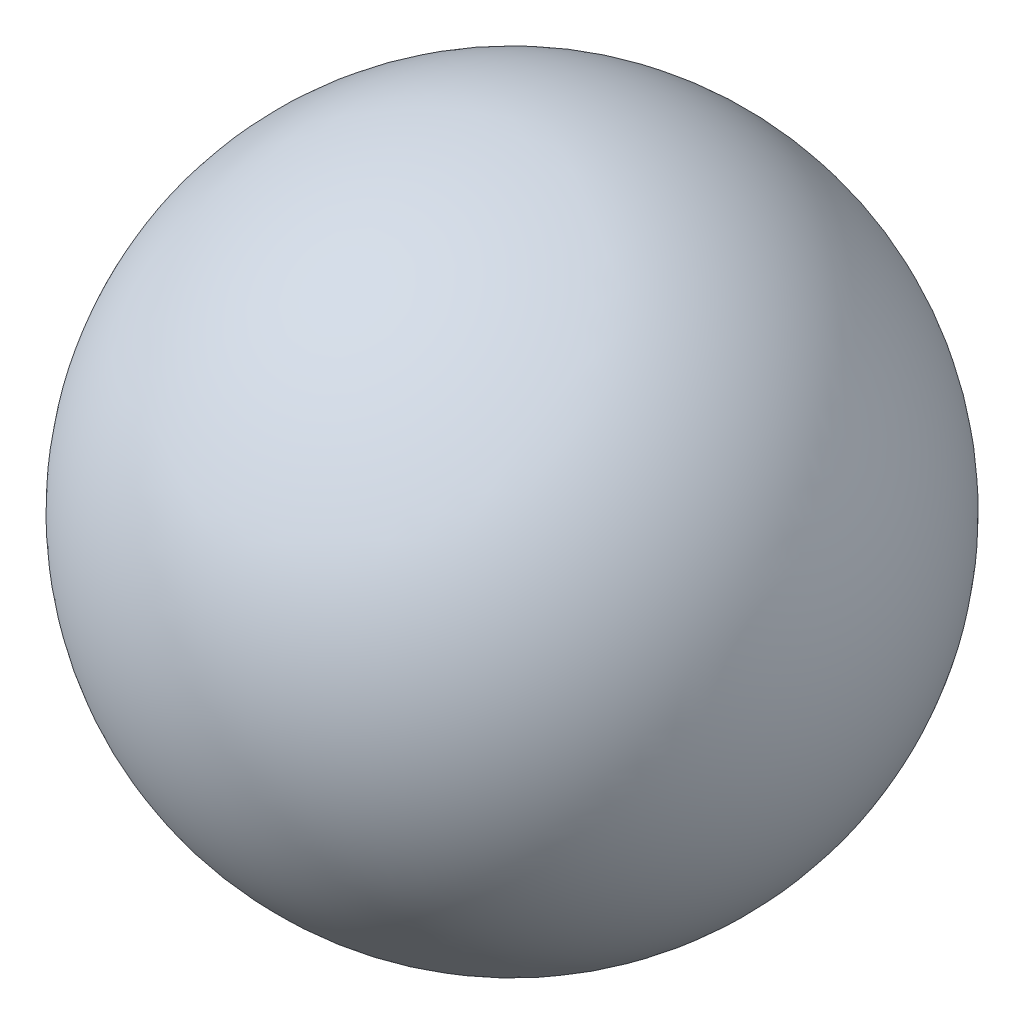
from build123d import *


with BuildPart() as part:
    # Esquisse1 → Base-R_volution (revolve)
    with BuildSketch(Plane(origin=(0, 0, 0), x_dir=(1, 0, 0), z_dir=(0, 1, 0))):
        with BuildLine():
            Line((0.95, 3.45), (5.45, 3.45))
            ThreePointArc((5.45, 3.45), (3.2, 5.7), (0.95, 3.45))
        make_face()
    revolve(axis=Axis((-0.3, 0, -3.45), (1, 0, 0)))


solid = part.part
